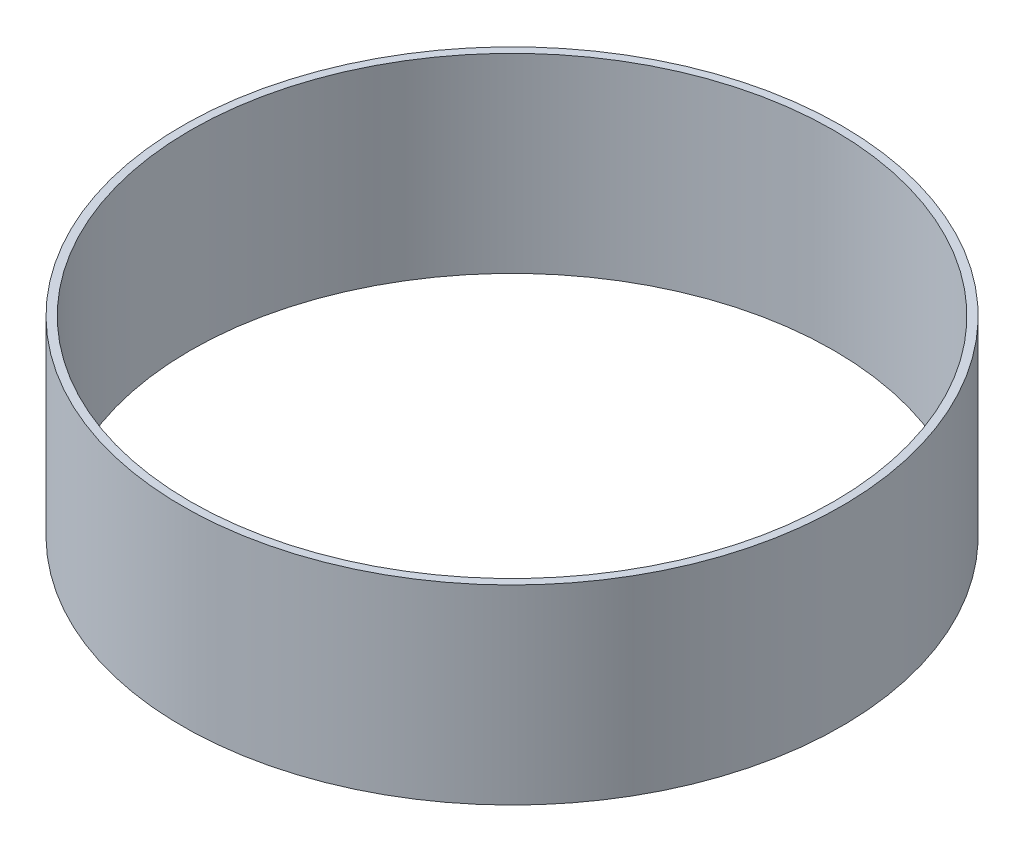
ISO-10303-21;
HEADER;
FILE_DESCRIPTION(('STEP AP214'),'2;1');
FILE_NAME('part.step','',(''),(''),'','','');
FILE_SCHEMA(('AUTOMOTIVE_DESIGN { 1 0 10303 214 1 1 1 1 }'));
ENDSEC;
DATA;
#1=APPLICATION_CONTEXT('core data for automotive mechanical design processes');
#2=APPLICATION_PROTOCOL_DEFINITION('international standard','automotive_design',2000,#1);
#3=PRODUCT_CONTEXT('',#1,'mechanical');
#4=PRODUCT('Part','Part','',(#3));
#5=PRODUCT_RELATED_PRODUCT_CATEGORY('part','',(#4));
#6=PRODUCT_DEFINITION_FORMATION('','',#4);
#7=PRODUCT_DEFINITION_CONTEXT('part definition',#1,'design');
#8=PRODUCT_DEFINITION('design','',#6,#7);
#9=PRODUCT_DEFINITION_SHAPE('','',#8);
#10=(LENGTH_UNIT() NAMED_UNIT(*) SI_UNIT(.MILLI.,.METRE.));
#11=(NAMED_UNIT(*) PLANE_ANGLE_UNIT() SI_UNIT($,.RADIAN.));
#12=(NAMED_UNIT(*) SI_UNIT($,.STERADIAN.) SOLID_ANGLE_UNIT());
#13=UNCERTAINTY_MEASURE_WITH_UNIT(LENGTH_MEASURE(1.E-05),#10,'distance_accuracy_value','');
#14=(GEOMETRIC_REPRESENTATION_CONTEXT(3) GLOBAL_UNCERTAINTY_ASSIGNED_CONTEXT((#13)) GLOBAL_UNIT_ASSIGNED_CONTEXT((#10,
#11,#12)) REPRESENTATION_CONTEXT('',''));
#15=CARTESIAN_POINT('',(0.,0.,0.));
#16=DIRECTION('',(0.,0.,1.));
#17=DIRECTION('',(1.,0.,0.));
#18=AXIS2_PLACEMENT_3D('',#15,#16,#17);
#19=CARTESIAN_POINT('',(0.,152.4,0.));
#20=DIRECTION('',(0.,1.,0.));
#21=DIRECTION('',(0.,0.,1.));
#22=AXIS2_PLACEMENT_3D('',#19,#20,#21);
#23=PLANE('',#22);
#24=CARTESIAN_POINT('',(0.,152.4,0.));
#25=DIRECTION('',(0.,1.,0.));
#26=DIRECTION('',(0.,0.,1.));
#27=AXIS2_PLACEMENT_3D('',#24,#25,#26);
#28=CIRCLE('',#27,263.525);
#29=CARTESIAN_POINT('',(0.,152.4,-263.525));
#30=VERTEX_POINT('',#29);
#31=EDGE_CURVE('E10',#30,#30,#28,.T.);
#32=ORIENTED_EDGE('',*,*,#31,.T.);
#33=EDGE_LOOP('',(#32));
#34=FACE_BOUND('',#33,.T.);
#35=CARTESIAN_POINT('',(0.,152.4,0.));
#36=DIRECTION('',(0.,1.,0.));
#37=DIRECTION('',(0.,0.,1.));
#38=AXIS2_PLACEMENT_3D('',#35,#36,#37);
#39=CIRCLE('',#38,257.175);
#40=CARTESIAN_POINT('',(0.,152.4,-257.175));
#41=VERTEX_POINT('',#40);
#42=EDGE_CURVE('E43',#41,#41,#39,.T.);
#43=ORIENTED_EDGE('',*,*,#42,.F.);
#44=EDGE_LOOP('',(#43));
#45=FACE_BOUND('',#44,.T.);
#46=ADVANCED_FACE('F32',(#34,#45),#23,.T.);
#47=CARTESIAN_POINT('',(0.,0.,0.));
#48=DIRECTION('',(0.,1.,0.));
#49=DIRECTION('',(0.,0.,1.));
#50=AXIS2_PLACEMENT_3D('',#47,#48,#49);
#51=PLANE('',#50);
#52=CARTESIAN_POINT('',(0.,0.,0.));
#53=DIRECTION('',(0.,1.,0.));
#54=DIRECTION('',(0.,0.,1.));
#55=AXIS2_PLACEMENT_3D('',#52,#53,#54);
#56=CIRCLE('',#55,263.525);
#57=CARTESIAN_POINT('',(0.,0.,-263.525));
#58=VERTEX_POINT('',#57);
#59=EDGE_CURVE('E36',#58,#58,#56,.T.);
#60=ORIENTED_EDGE('',*,*,#59,.F.);
#61=EDGE_LOOP('',(#60));
#62=FACE_BOUND('',#61,.T.);
#63=CARTESIAN_POINT('',(0.,0.,0.));
#64=DIRECTION('',(0.,1.,0.));
#65=DIRECTION('',(0.,0.,1.));
#66=AXIS2_PLACEMENT_3D('',#63,#64,#65);
#67=CIRCLE('',#66,257.175);
#68=CARTESIAN_POINT('',(0.,0.,-257.175));
#69=VERTEX_POINT('',#68);
#70=EDGE_CURVE('E45',#69,#69,#67,.T.);
#71=ORIENTED_EDGE('',*,*,#70,.T.);
#72=EDGE_LOOP('',(#71));
#73=FACE_BOUND('',#72,.T.);
#74=ADVANCED_FACE('F55',(#62,#73),#51,.F.);
#75=CARTESIAN_POINT('',(0.,152.4,0.));
#76=DIRECTION('',(0.,-1.,0.));
#77=DIRECTION('',(0.,0.,-1.));
#78=AXIS2_PLACEMENT_3D('',#75,#76,#77);
#79=CYLINDRICAL_SURFACE('',#78,263.525);
#80=CARTESIAN_POINT('',(0.,152.4,-263.525));
#81=CARTESIAN_POINT('',(0.,150.8125,-263.525));
#82=CARTESIAN_POINT('',(0.,149.225,-263.525));
#83=CARTESIAN_POINT('',(0.,146.05,-263.525));
#84=CARTESIAN_POINT('',(0.,144.4625,-263.525));
#85=CARTESIAN_POINT('',(0.,141.2875,-263.525));
#86=CARTESIAN_POINT('',(0.,139.7,-263.525));
#87=CARTESIAN_POINT('',(0.,136.525,-263.525));
#88=CARTESIAN_POINT('',(0.,134.9375,-263.525));
#89=CARTESIAN_POINT('',(0.,131.7625,-263.525));
#90=CARTESIAN_POINT('',(0.,130.175,-263.525));
#91=CARTESIAN_POINT('',(0.,127.,-263.525));
#92=CARTESIAN_POINT('',(0.,125.4125,-263.525));
#93=CARTESIAN_POINT('',(0.,122.2375,-263.525));
#94=CARTESIAN_POINT('',(0.,120.65,-263.525));
#95=CARTESIAN_POINT('',(0.,117.475,-263.525));
#96=CARTESIAN_POINT('',(0.,115.8875,-263.525));
#97=CARTESIAN_POINT('',(0.,112.7125,-263.525));
#98=CARTESIAN_POINT('',(0.,111.125,-263.525));
#99=CARTESIAN_POINT('',(0.,107.95,-263.525));
#100=CARTESIAN_POINT('',(0.,106.3625,-263.525));
#101=CARTESIAN_POINT('',(0.,103.1875,-263.525));
#102=CARTESIAN_POINT('',(0.,101.6,-263.525));
#103=CARTESIAN_POINT('',(0.,98.425,-263.525));
#104=CARTESIAN_POINT('',(0.,96.8375,-263.525));
#105=CARTESIAN_POINT('',(0.,93.6625,-263.525));
#106=CARTESIAN_POINT('',(0.,92.075,-263.525));
#107=CARTESIAN_POINT('',(0.,88.9,-263.525));
#108=CARTESIAN_POINT('',(0.,87.3125,-263.525));
#109=CARTESIAN_POINT('',(0.,84.1375,-263.525));
#110=CARTESIAN_POINT('',(0.,82.55,-263.525));
#111=CARTESIAN_POINT('',(0.,79.375,-263.525));
#112=CARTESIAN_POINT('',(0.,77.7875,-263.525));
#113=CARTESIAN_POINT('',(0.,74.6125,-263.525));
#114=CARTESIAN_POINT('',(0.,73.025,-263.525));
#115=CARTESIAN_POINT('',(0.,69.85,-263.525));
#116=CARTESIAN_POINT('',(0.,68.2625,-263.525));
#117=CARTESIAN_POINT('',(0.,65.0875,-263.525));
#118=CARTESIAN_POINT('',(0.,63.5,-263.525));
#119=CARTESIAN_POINT('',(0.,60.325,-263.525));
#120=CARTESIAN_POINT('',(0.,58.7375,-263.525));
#121=CARTESIAN_POINT('',(0.,55.5625,-263.525));
#122=CARTESIAN_POINT('',(0.,53.975,-263.525));
#123=CARTESIAN_POINT('',(0.,50.8,-263.525));
#124=CARTESIAN_POINT('',(0.,49.2125,-263.525));
#125=CARTESIAN_POINT('',(0.,46.0375,-263.525));
#126=CARTESIAN_POINT('',(0.,44.45,-263.525));
#127=CARTESIAN_POINT('',(0.,41.275,-263.525));
#128=CARTESIAN_POINT('',(0.,39.6875,-263.525));
#129=CARTESIAN_POINT('',(0.,36.5125,-263.525));
#130=CARTESIAN_POINT('',(0.,34.925,-263.525));
#131=CARTESIAN_POINT('',(0.,31.75,-263.525));
#132=CARTESIAN_POINT('',(0.,30.1625,-263.525));
#133=CARTESIAN_POINT('',(0.,26.9875,-263.525));
#134=CARTESIAN_POINT('',(0.,25.4,-263.525));
#135=CARTESIAN_POINT('',(0.,22.225,-263.525));
#136=CARTESIAN_POINT('',(0.,20.6375,-263.525));
#137=CARTESIAN_POINT('',(0.,17.4625,-263.525));
#138=CARTESIAN_POINT('',(0.,15.875,-263.525));
#139=CARTESIAN_POINT('',(0.,12.7,-263.525));
#140=CARTESIAN_POINT('',(0.,11.1125,-263.525));
#141=CARTESIAN_POINT('',(0.,7.93750000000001,-263.525));
#142=CARTESIAN_POINT('',(0.,6.35,-263.525));
#143=CARTESIAN_POINT('',(0.,3.175,-263.525));
#144=CARTESIAN_POINT('',(0.,1.5875,-263.525));
#145=CARTESIAN_POINT('',(0.,0.,-263.525));
#146=B_SPLINE_CURVE_WITH_KNOTS('',3,(#80,#81,#82,#83,#84,#85,#86,#87,#88,#89,#90,#91,#92,#93,
#94,#95,#96,#97,#98,#99,#100,#101,#102,#103,#104,#105,#106,#107,#108,#109,#110,#111,#112,#113,
#114,#115,#116,#117,#118,#119,#120,#121,#122,#123,#124,#125,#126,#127,#128,#129,#130,#131,#132,
#133,#134,#135,#136,#137,#138,#139,#140,#141,#142,#143,#144,#145),.UNSPECIFIED.,.F.,.F.,(4,2,2,
2,2,2,2,2,2,2,2,2,2,2,2,2,2,2,2,2,2,2,2,2,2,2,2,2,2,2,2,2,4),(0.,4.7625,9.52500000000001,
14.2875,19.05,23.8125,28.575,33.3375,38.1,42.8625,47.625,52.3875,57.15,61.9125,66.675,71.4375,
76.2,80.9625,85.725,90.4875,95.25,100.0125,104.775,109.5375,114.3,119.0625,123.825,128.5875,
133.35,138.1125,142.875,147.6375,152.4),.UNSPECIFIED.);
#147=EDGE_CURVE('BSEAM34',#30,#58,#146,.T.);
#148=ORIENTED_EDGE('',*,*,#31,.F.);
#149=ORIENTED_EDGE('',*,*,#59,.T.);
#150=ORIENTED_EDGE('',*,*,#147,.T.);
#151=ORIENTED_EDGE('',*,*,#147,.F.);
#152=EDGE_LOOP('',(#148,#150,#149,#151));
#153=FACE_BOUND('',#152,.T.);
#154=ADVANCED_FACE('F34',(#153),#79,.T.);
#155=CARTESIAN_POINT('',(0.,152.4,0.));
#156=DIRECTION('',(0.,-1.,0.));
#157=DIRECTION('',(0.,0.,-1.));
#158=AXIS2_PLACEMENT_3D('',#155,#156,#157);
#159=CYLINDRICAL_SURFACE('',#158,257.175);
#160=CARTESIAN_POINT('',(0.,152.4,-257.175));
#161=CARTESIAN_POINT('',(0.,150.8125,-257.175));
#162=CARTESIAN_POINT('',(0.,149.225,-257.175));
#163=CARTESIAN_POINT('',(0.,146.05,-257.175));
#164=CARTESIAN_POINT('',(0.,144.4625,-257.175));
#165=CARTESIAN_POINT('',(0.,141.2875,-257.175));
#166=CARTESIAN_POINT('',(0.,139.7,-257.175));
#167=CARTESIAN_POINT('',(0.,136.525,-257.175));
#168=CARTESIAN_POINT('',(0.,134.9375,-257.175));
#169=CARTESIAN_POINT('',(0.,131.7625,-257.175));
#170=CARTESIAN_POINT('',(0.,130.175,-257.175));
#171=CARTESIAN_POINT('',(0.,127.,-257.175));
#172=CARTESIAN_POINT('',(0.,125.4125,-257.175));
#173=CARTESIAN_POINT('',(0.,122.2375,-257.175));
#174=CARTESIAN_POINT('',(0.,120.65,-257.175));
#175=CARTESIAN_POINT('',(0.,117.475,-257.175));
#176=CARTESIAN_POINT('',(0.,115.8875,-257.175));
#177=CARTESIAN_POINT('',(0.,112.7125,-257.175));
#178=CARTESIAN_POINT('',(0.,111.125,-257.175));
#179=CARTESIAN_POINT('',(0.,107.95,-257.175));
#180=CARTESIAN_POINT('',(0.,106.3625,-257.175));
#181=CARTESIAN_POINT('',(0.,103.1875,-257.175));
#182=CARTESIAN_POINT('',(0.,101.6,-257.175));
#183=CARTESIAN_POINT('',(0.,98.425,-257.175));
#184=CARTESIAN_POINT('',(0.,96.8375,-257.175));
#185=CARTESIAN_POINT('',(0.,93.6625,-257.175));
#186=CARTESIAN_POINT('',(0.,92.075,-257.175));
#187=CARTESIAN_POINT('',(0.,88.9,-257.175));
#188=CARTESIAN_POINT('',(0.,87.3125,-257.175));
#189=CARTESIAN_POINT('',(0.,84.1375,-257.175));
#190=CARTESIAN_POINT('',(0.,82.55,-257.175));
#191=CARTESIAN_POINT('',(0.,79.375,-257.175));
#192=CARTESIAN_POINT('',(0.,77.7875,-257.175));
#193=CARTESIAN_POINT('',(0.,74.6125,-257.175));
#194=CARTESIAN_POINT('',(0.,73.025,-257.175));
#195=CARTESIAN_POINT('',(0.,69.85,-257.175));
#196=CARTESIAN_POINT('',(0.,68.2625,-257.175));
#197=CARTESIAN_POINT('',(0.,65.0875,-257.175));
#198=CARTESIAN_POINT('',(0.,63.5,-257.175));
#199=CARTESIAN_POINT('',(0.,60.325,-257.175));
#200=CARTESIAN_POINT('',(0.,58.7375,-257.175));
#201=CARTESIAN_POINT('',(0.,55.5625,-257.175));
#202=CARTESIAN_POINT('',(0.,53.975,-257.175));
#203=CARTESIAN_POINT('',(0.,50.8,-257.175));
#204=CARTESIAN_POINT('',(0.,49.2125,-257.175));
#205=CARTESIAN_POINT('',(0.,46.0375,-257.175));
#206=CARTESIAN_POINT('',(0.,44.45,-257.175));
#207=CARTESIAN_POINT('',(0.,41.275,-257.175));
#208=CARTESIAN_POINT('',(0.,39.6875,-257.175));
#209=CARTESIAN_POINT('',(0.,36.5125,-257.175));
#210=CARTESIAN_POINT('',(0.,34.925,-257.175));
#211=CARTESIAN_POINT('',(0.,31.75,-257.175));
#212=CARTESIAN_POINT('',(0.,30.1625,-257.175));
#213=CARTESIAN_POINT('',(0.,26.9875,-257.175));
#214=CARTESIAN_POINT('',(0.,25.4,-257.175));
#215=CARTESIAN_POINT('',(0.,22.225,-257.175));
#216=CARTESIAN_POINT('',(0.,20.6375,-257.175));
#217=CARTESIAN_POINT('',(0.,17.4625,-257.175));
#218=CARTESIAN_POINT('',(0.,15.875,-257.175));
#219=CARTESIAN_POINT('',(0.,12.7,-257.175));
#220=CARTESIAN_POINT('',(0.,11.1125,-257.175));
#221=CARTESIAN_POINT('',(0.,7.93750000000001,-257.175));
#222=CARTESIAN_POINT('',(0.,6.35,-257.175));
#223=CARTESIAN_POINT('',(0.,3.175,-257.175));
#224=CARTESIAN_POINT('',(0.,1.5875,-257.175));
#225=CARTESIAN_POINT('',(0.,0.,-257.175));
#226=B_SPLINE_CURVE_WITH_KNOTS('',3,(#160,#161,#162,#163,#164,#165,#166,#167,#168,#169,#170,
#171,#172,#173,#174,#175,#176,#177,#178,#179,#180,#181,#182,#183,#184,#185,#186,#187,#188,#189,
#190,#191,#192,#193,#194,#195,#196,#197,#198,#199,#200,#201,#202,#203,#204,#205,#206,#207,#208,
#209,#210,#211,#212,#213,#214,#215,#216,#217,#218,#219,#220,#221,#222,#223,#224,#225),
.UNSPECIFIED.,.F.,.F.,(4,2,2,2,2,2,2,2,2,2,2,2,2,2,2,2,2,2,2,2,2,2,2,2,2,2,2,2,2,2,2,2,4),(0.,
4.76249999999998,9.52499999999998,14.2875,19.05,23.8125,28.575,33.3375,38.1,42.8625,47.625,
52.3875,57.15,61.9125,66.675,71.4375,76.2,80.9625,85.725,90.4875,95.25,100.0125,104.775,
109.5375,114.3,119.0625,123.825,128.5875,133.35,138.1125,142.875,147.6375,152.4),.UNSPECIFIED.);
#227=EDGE_CURVE('BSEAM51',#41,#69,#226,.T.);
#228=ORIENTED_EDGE('',*,*,#42,.T.);
#229=ORIENTED_EDGE('',*,*,#70,.F.);
#230=ORIENTED_EDGE('',*,*,#227,.T.);
#231=ORIENTED_EDGE('',*,*,#227,.F.);
#232=EDGE_LOOP('',(#228,#230,#229,#231));
#233=FACE_BOUND('',#232,.T.);
#234=ADVANCED_FACE('F51',(#233),#159,.F.);
#235=CLOSED_SHELL('',(#46,#74,#154,#234));
#236=MANIFOLD_SOLID_BREP('B2',#235);
#237=ADVANCED_BREP_SHAPE_REPRESENTATION('',(#18,#236),#14);
#238=SHAPE_DEFINITION_REPRESENTATION(#9,#237);
ENDSEC;
END-ISO-10303-21;
